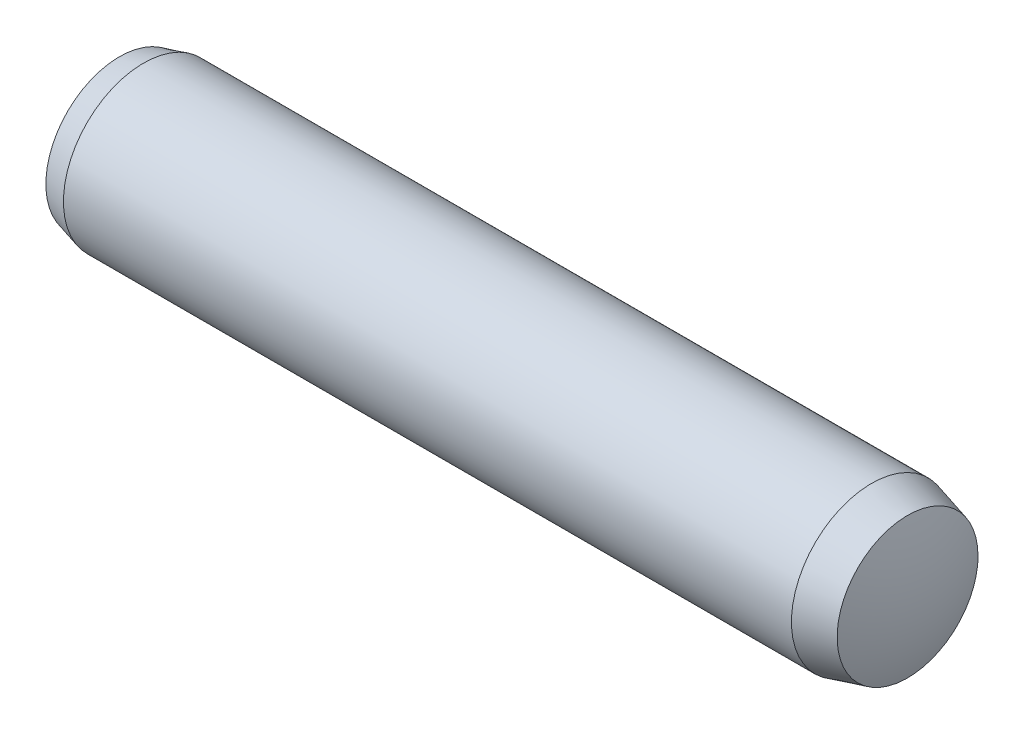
ISO-10303-21;
HEADER;
FILE_DESCRIPTION(('STEP AP214'),'2;1');
FILE_NAME('part.step','',(''),(''),'','','');
FILE_SCHEMA(('AUTOMOTIVE_DESIGN { 1 0 10303 214 1 1 1 1 }'));
ENDSEC;
DATA;
#1=APPLICATION_CONTEXT('core data for automotive mechanical design processes');
#2=APPLICATION_PROTOCOL_DEFINITION('international standard','automotive_design',2000,#1);
#3=PRODUCT_CONTEXT('',#1,'mechanical');
#4=PRODUCT('Part','Part','',(#3));
#5=PRODUCT_RELATED_PRODUCT_CATEGORY('part','',(#4));
#6=PRODUCT_DEFINITION_FORMATION('','',#4);
#7=PRODUCT_DEFINITION_CONTEXT('part definition',#1,'design');
#8=PRODUCT_DEFINITION('design','',#6,#7);
#9=PRODUCT_DEFINITION_SHAPE('','',#8);
#10=(LENGTH_UNIT() NAMED_UNIT(*) SI_UNIT(.MILLI.,.METRE.));
#11=(NAMED_UNIT(*) PLANE_ANGLE_UNIT() SI_UNIT($,.RADIAN.));
#12=(NAMED_UNIT(*) SI_UNIT($,.STERADIAN.) SOLID_ANGLE_UNIT());
#13=UNCERTAINTY_MEASURE_WITH_UNIT(LENGTH_MEASURE(1.E-05),#10,'distance_accuracy_value','');
#14=(GEOMETRIC_REPRESENTATION_CONTEXT(3) GLOBAL_UNCERTAINTY_ASSIGNED_CONTEXT((#13)) GLOBAL_UNIT_ASSIGNED_CONTEXT((#10,
#11,#12)) REPRESENTATION_CONTEXT('',''));
#15=CARTESIAN_POINT('',(0.,0.,0.));
#16=DIRECTION('',(0.,0.,1.));
#17=DIRECTION('',(1.,0.,0.));
#18=AXIS2_PLACEMENT_3D('',#15,#16,#17);
#19=CARTESIAN_POINT('',(8.8,0.,0.));
#20=DIRECTION('',(-1.,0.,0.));
#21=DIRECTION('',(0.,0.,1.));
#22=AXIS2_PLACEMENT_3D('',#19,#20,#21);
#23=CONICAL_SURFACE('',#22,2.01,1.04719755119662);
#24=CARTESIAN_POINT('',(9.9604740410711,0.,0.));
#25=VERTEX_POINT('',#24);
#26=VERTEX_LOOP('',#25);
#27=FACE_BOUND('',#26,.T.);
#28=CARTESIAN_POINT('',(8.8,0.,0.));
#29=DIRECTION('',(1.,0.,0.));
#30=DIRECTION('',(0.,0.,-1.));
#31=AXIS2_PLACEMENT_3D('',#28,#29,#30);
#32=CIRCLE('',#31,2.01);
#33=CARTESIAN_POINT('',(8.8,0.,-2.01));
#34=VERTEX_POINT('',#33);
#35=EDGE_CURVE('E48',#34,#34,#32,.T.);
#36=ORIENTED_EDGE('',*,*,#35,.F.);
#37=EDGE_LOOP('',(#36));
#38=FACE_BOUND('',#37,.T.);
#39=ADVANCED_FACE('F36',(#27,#38),#23,.F.);
#40=CARTESIAN_POINT('',(40.,0.,0.));
#41=DIRECTION('',(1.,0.,0.));
#42=DIRECTION('',(0.,0.,-1.));
#43=AXIS2_PLACEMENT_3D('',#40,#41,#42);
#44=CYLINDRICAL_SURFACE('',#43,2.01);
#45=ORIENTED_EDGE('',*,*,#35,.T.);
#46=EDGE_LOOP('',(#45));
#47=FACE_BOUND('',#46,.T.);
#48=CARTESIAN_POINT('',(0.800000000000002,0.,0.));
#49=DIRECTION('',(1.,0.,0.));
#50=DIRECTION('',(0.,0.,-1.));
#51=AXIS2_PLACEMENT_3D('',#48,#49,#50);
#52=CIRCLE('',#51,2.01);
#53=CARTESIAN_POINT('',(0.800000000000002,0.,-2.01));
#54=VERTEX_POINT('',#53);
#55=EDGE_CURVE('E97',#54,#54,#52,.T.);
#56=ORIENTED_EDGE('',*,*,#55,.F.);
#57=EDGE_LOOP('',(#56));
#58=FACE_BOUND('',#57,.T.);
#59=ADVANCED_FACE('F102',(#47,#58),#44,.F.);
#60=CARTESIAN_POINT('',(0.8,0.,-2.01));
#61=DIRECTION('',(-1.,0.,0.));
#62=DIRECTION('',(0.,0.,1.));
#63=AXIS2_PLACEMENT_3D('',#60,#61,#62);
#64=PLANE('',#63);
#65=ORIENTED_EDGE('',*,*,#55,.T.);
#66=EDGE_LOOP('',(#65));
#67=FACE_BOUND('',#66,.T.);
#68=CARTESIAN_POINT('',(0.800000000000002,0.,0.));
#69=DIRECTION('',(1.,0.,0.));
#70=DIRECTION('',(0.,0.,-1.));
#71=AXIS2_PLACEMENT_3D('',#68,#69,#70);
#72=CIRCLE('',#71,3.25);
#73=CARTESIAN_POINT('',(0.800000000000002,0.,-3.25));
#74=VERTEX_POINT('',#73);
#75=EDGE_CURVE('E94',#74,#74,#72,.T.);
#76=ORIENTED_EDGE('',*,*,#75,.F.);
#77=EDGE_LOOP('',(#76));
#78=FACE_BOUND('',#77,.T.);
#79=ADVANCED_FACE('F109',(#67,#78),#64,.T.);
#80=CARTESIAN_POINT('',(40.,0.,0.));
#81=DIRECTION('',(1.,0.,0.));
#82=DIRECTION('',(0.,0.,-1.));
#83=AXIS2_PLACEMENT_3D('',#80,#81,#82);
#84=CYLINDRICAL_SURFACE('',#83,3.25);
#85=ORIENTED_EDGE('',*,*,#75,.T.);
#86=EDGE_LOOP('',(#85));
#87=FACE_BOUND('',#86,.T.);
#88=CARTESIAN_POINT('',(0.,0.,0.));
#89=DIRECTION('',(1.,0.,0.));
#90=DIRECTION('',(0.,0.,-1.));
#91=AXIS2_PLACEMENT_3D('',#88,#89,#90);
#92=CIRCLE('',#91,3.25);
#93=CARTESIAN_POINT('',(0.,0.,-3.25));
#94=VERTEX_POINT('',#93);
#95=EDGE_CURVE('E87',#94,#94,#92,.T.);
#96=ORIENTED_EDGE('',*,*,#95,.F.);
#97=EDGE_LOOP('',(#96));
#98=FACE_BOUND('',#97,.T.);
#99=ADVANCED_FACE('F113',(#87,#98),#84,.F.);
#100=CARTESIAN_POINT('',(0.,0.,-3.25));
#101=DIRECTION('',(-1.,0.,0.));
#102=DIRECTION('',(0.,0.,1.));
#103=AXIS2_PLACEMENT_3D('',#100,#101,#102);
#104=PLANE('',#103);
#105=ORIENTED_EDGE('',*,*,#95,.T.);
#106=EDGE_LOOP('',(#105));
#107=FACE_BOUND('',#106,.T.);
#108=CARTESIAN_POINT('',(0.,0.,0.));
#109=DIRECTION('',(1.,0.,0.));
#110=DIRECTION('',(0.,0.,-1.));
#111=AXIS2_PLACEMENT_3D('',#108,#109,#110);
#112=CIRCLE('',#111,3.6784609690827);
#113=CARTESIAN_POINT('',(0.,0.,-3.6784609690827));
#114=VERTEX_POINT('',#113);
#115=EDGE_CURVE('E84',#114,#114,#112,.T.);
#116=ORIENTED_EDGE('',*,*,#115,.F.);
#117=EDGE_LOOP('',(#116));
#118=FACE_BOUND('',#117,.T.);
#119=ADVANCED_FACE('F119',(#107,#118),#104,.T.);
#120=CARTESIAN_POINT('',(1.2,0.,0.));
#121=DIRECTION('',(1.,0.,0.));
#122=DIRECTION('',(0.,0.,-1.));
#123=AXIS2_PLACEMENT_3D('',#120,#121,#122);
#124=CONICAL_SURFACE('',#123,4.,0.261799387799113);
#125=CARTESIAN_POINT('',(2.56615447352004,-1.82002192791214,-3.9686269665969));
#126=CARTESIAN_POINT('',(2.47861791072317,-1.76368052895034,-3.9686269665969));
#127=CARTESIAN_POINT('',(2.39195567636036,-1.70588387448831,-3.9686269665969));
#128=CARTESIAN_POINT('',(2.22088984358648,-1.58629618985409,-3.9686269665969));
#129=CARTESIAN_POINT('',(2.13649750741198,-1.52448911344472,-3.9686269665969));
#130=CARTESIAN_POINT('',(1.96789095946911,-1.39366145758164,-3.9686269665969));
#131=CARTESIAN_POINT('',(1.88382315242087,-1.32444987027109,-3.9686269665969));
#132=CARTESIAN_POINT('',(1.72139812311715,-1.17980611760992,-3.9686269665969));
#133=CARTESIAN_POINT('',(1.64303054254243,-1.10438579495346,-3.9686269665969));
#134=CARTESIAN_POINT('',(1.49757048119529,-0.948534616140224,-3.9686269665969));
#135=CARTESIAN_POINT('',(1.43016253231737,-0.868403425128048,-3.9686269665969));
#136=CARTESIAN_POINT('',(1.30826214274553,-0.699752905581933,-3.9686269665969));
#137=CARTESIAN_POINT('',(1.25363698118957,-0.611334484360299,-3.9686269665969));
#138=CARTESIAN_POINT('',(1.18138172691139,-0.461772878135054,-3.9686269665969));
#139=CARTESIAN_POINT('',(1.15765556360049,-0.403610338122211,-3.9686269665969));
#140=CARTESIAN_POINT('',(1.1193300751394,-0.28464914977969,-3.9686269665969));
#141=CARTESIAN_POINT('',(1.1046770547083,-0.223868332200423,-3.9686269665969));
#142=CARTESIAN_POINT('',(1.08590416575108,-0.10067944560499,-3.9686269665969));
#143=CARTESIAN_POINT('',(1.08177956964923,-0.0382721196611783,-3.9686269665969));
#144=CARTESIAN_POINT('',(1.08459246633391,0.0863557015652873,-3.9686269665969));
#145=CARTESIAN_POINT('',(1.0915421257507,0.148575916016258,-3.9686269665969));
#146=CARTESIAN_POINT('',(1.11563331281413,0.270941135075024,-3.9686269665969));
#147=CARTESIAN_POINT('',(1.13277564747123,0.33108597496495,-3.9686269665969));
#148=CARTESIAN_POINT('',(1.18426902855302,0.472297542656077,-3.9686269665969));
#149=CARTESIAN_POINT('',(1.22279536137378,0.551819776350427,-3.9686269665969));
#150=CARTESIAN_POINT('',(1.31182615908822,0.704543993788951,-3.9686269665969));
#151=CARTESIAN_POINT('',(1.36244163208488,0.777678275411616,-3.9686269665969));
#152=CARTESIAN_POINT('',(1.48384015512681,0.933412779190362,-3.9686269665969));
#153=CARTESIAN_POINT('',(1.5565989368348,1.01444433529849,-3.9686269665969));
#154=CARTESIAN_POINT('',(1.70979689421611,1.16919817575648,-3.9686269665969));
#155=CARTESIAN_POINT('',(1.79026027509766,1.24289583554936,-3.9686269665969));
#156=CARTESIAN_POINT('',(1.95246180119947,1.3812137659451,-3.9686269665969));
#157=CARTESIAN_POINT('',(2.0339829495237,1.44609231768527,-3.9686269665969));
#158=CARTESIAN_POINT('',(2.1997445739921,1.57101808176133,-3.9686269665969));
#159=CARTESIAN_POINT('',(2.28396126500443,1.63109669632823,-3.9686269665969));
#160=CARTESIAN_POINT('',(2.36921445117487,1.68951804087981,-3.9686269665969));
#161=B_SPLINE_CURVE_WITH_KNOTS('',3,(#125,#126,#127,#128,#129,#130,#131,#132,#133,#134,#135,
#136,#137,#138,#139,#140,#141,#142,#143,#144,#145,#146,#147,#148,#149,#150,#151,#152,#153,#154,
#155,#156,#157,#158,#159,#160),.UNSPECIFIED.,.F.,.F.,(4,2,2,2,2,2,2,2,2,2,2,2,2,2,2,2,2,4),(0.,
0.312367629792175,0.626073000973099,0.952517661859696,1.27835347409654,1.59179667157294,
1.90182469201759,2.08969168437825,2.27643597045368,2.46309638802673,2.64996201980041,
2.83684244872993,3.10042354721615,3.36652490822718,3.69245455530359,4.01944403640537,
4.33184638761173,4.64200105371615),.UNSPECIFIED.);
#162=CARTESIAN_POINT('',(1.2,-0.5,-3.9686269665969));
#163=VERTEX_POINT('',#162);
#164=CARTESIAN_POINT('',(1.2,0.5,-3.9686269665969));
#165=VERTEX_POINT('',#164);
#166=EDGE_CURVE('E66',#163,#165,#161,.T.);
#167=ORIENTED_EDGE('',*,*,#166,.F.);
#168=CARTESIAN_POINT('',(1.2,0.,0.));
#169=DIRECTION('',(1.,0.,0.));
#170=DIRECTION('',(0.,0.,-1.));
#171=AXIS2_PLACEMENT_3D('',#168,#169,#170);
#172=CIRCLE('',#171,4.);
#173=EDGE_CURVE('E78',#165,#163,#172,.T.);
#174=ORIENTED_EDGE('',*,*,#173,.F.);
#175=EDGE_LOOP('',(#167,#174));
#176=FACE_BOUND('',#175,.T.);
#177=ORIENTED_EDGE('',*,*,#115,.T.);
#178=EDGE_LOOP('',(#177));
#179=FACE_BOUND('',#178,.T.);
#180=ADVANCED_FACE('F82',(#176,#179),#124,.T.);
#181=CARTESIAN_POINT('',(40.,0.,0.));
#182=DIRECTION('',(1.,0.,0.));
#183=DIRECTION('',(0.,0.,-1.));
#184=AXIS2_PLACEMENT_3D('',#181,#182,#183);
#185=CYLINDRICAL_SURFACE('',#184,4.);
#186=DIRECTION('',(-1.,0.,0.));
#187=VECTOR('',#186,1.);
#188=CARTESIAN_POINT('',(40.8,-0.5,-3.9686269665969));
#189=LINE('',#188,#187);
#190=CARTESIAN_POINT('',(37.56,-0.5,-3.9686269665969));
#191=VERTEX_POINT('',#190);
#192=EDGE_CURVE('E69',#191,#163,#189,.T.);
#193=ORIENTED_EDGE('',*,*,#192,.F.);
#194=CARTESIAN_POINT('',(37.56,0.,0.));
#195=DIRECTION('',(1.,0.,0.));
#196=DIRECTION('',(0.,0.,-1.));
#197=AXIS2_PLACEMENT_3D('',#194,#195,#196);
#198=CIRCLE('',#197,4.);
#199=CARTESIAN_POINT('',(37.56,0.499999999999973,-3.96862696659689));
#200=VERTEX_POINT('',#199);
#201=EDGE_CURVE('E80',#200,#191,#198,.T.);
#202=ORIENTED_EDGE('',*,*,#201,.F.);
#203=DIRECTION('',(-1.,0.,0.));
#204=VECTOR('',#203,1.);
#205=CARTESIAN_POINT('',(40.8,0.5,-3.9686269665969));
#206=LINE('',#205,#204);
#207=EDGE_CURVE('E54',#200,#165,#206,.T.);
#208=ORIENTED_EDGE('',*,*,#207,.T.);
#209=ORIENTED_EDGE('',*,*,#173,.T.);
#210=EDGE_LOOP('',(#193,#202,#208,#209));
#211=FACE_BOUND('',#210,.T.);
#212=ADVANCED_FACE('F77',(#211),#185,.T.);
#213=CARTESIAN_POINT('',(39.360965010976,0.,0.));
#214=DIRECTION('',(-1.,0.,0.));
#215=DIRECTION('',(0.,0.,1.));
#216=AXIS2_PLACEMENT_3D('',#213,#214,#215);
#217=CONICAL_SURFACE('',#216,3.5174328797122,0.261799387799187);
#218=CARTESIAN_POINT('',(36.850640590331,-1.34413753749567,-3.9686269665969));
#219=CARTESIAN_POINT('',(36.8958566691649,-1.30634733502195,-3.9686269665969));
#220=CARTESIAN_POINT('',(36.9404061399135,-1.26772777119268,-3.9686269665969));
#221=CARTESIAN_POINT('',(37.0278469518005,-1.18848770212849,-3.9686269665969));
#222=CARTESIAN_POINT('',(37.0707347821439,-1.1478633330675,-3.9686269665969));
#223=CARTESIAN_POINT('',(37.1552953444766,-1.06347009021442,-3.9686269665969));
#224=CARTESIAN_POINT('',(37.1969180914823,-1.01965064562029,-3.9686269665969));
#225=CARTESIAN_POINT('',(37.2772082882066,-0.929434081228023,-3.9686269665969));
#226=CARTESIAN_POINT('',(37.3158780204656,-0.883039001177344,-3.9686269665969));
#227=CARTESIAN_POINT('',(37.405308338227,-0.766696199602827,-3.9686269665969));
#228=CARTESIAN_POINT('',(37.4541091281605,-0.695206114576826,-3.9686269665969));
#229=CARTESIAN_POINT('',(37.5400394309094,-0.546038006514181,-3.9686269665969));
#230=CARTESIAN_POINT('',(37.5772664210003,-0.468418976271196,-3.9686269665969));
#231=CARTESIAN_POINT('',(37.6164633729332,-0.360477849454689,-3.9686269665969));
#232=CARTESIAN_POINT('',(37.6255053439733,-0.332677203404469,-3.9686269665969));
#233=CARTESIAN_POINT('',(37.6415647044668,-0.276450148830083,-3.9686269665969));
#234=CARTESIAN_POINT('',(37.6485788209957,-0.248022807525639,-3.9686269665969));
#235=CARTESIAN_POINT('',(37.6670973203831,-0.158042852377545,-3.9686269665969));
#236=CARTESIAN_POINT('',(37.6746296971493,-0.095603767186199,-3.9686269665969));
#237=CARTESIAN_POINT('',(37.6785183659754,0.0296237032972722,-3.9686269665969));
#238=CARTESIAN_POINT('',(37.6748713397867,0.092412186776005,-3.9686269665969));
#239=CARTESIAN_POINT('',(37.6569228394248,0.216164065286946,-3.9686269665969));
#240=CARTESIAN_POINT('',(37.642661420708,0.277133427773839,-3.9686269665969));
#241=CARTESIAN_POINT('',(37.6051287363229,0.396151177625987,-3.9686269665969));
#242=CARTESIAN_POINT('',(37.5818552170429,0.454198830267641,-3.9686269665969));
#243=CARTESIAN_POINT('',(37.5106520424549,0.603758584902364,-3.9686269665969));
#244=CARTESIAN_POINT('',(37.4565531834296,0.692317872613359,-3.9686269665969));
#245=CARTESIAN_POINT('',(37.3660379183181,0.818662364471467,-3.9686269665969));
#246=CARTESIAN_POINT('',(37.3341057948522,0.85990049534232,-3.9686269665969));
#247=CARTESIAN_POINT('',(37.2677329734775,0.94030253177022,-3.9686269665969));
#248=CARTESIAN_POINT('',(37.2332932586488,0.97946723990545,-3.9686269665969));
#249=CARTESIAN_POINT('',(37.146279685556,1.07333563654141,-3.9686269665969));
#250=CARTESIAN_POINT('',(37.0925882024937,1.12699611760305,-3.9686269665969));
#251=CARTESIAN_POINT('',(36.9820557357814,1.2309891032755,-3.9686269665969));
#252=CARTESIAN_POINT('',(36.9252130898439,1.28131982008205,-3.9686269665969));
#253=CARTESIAN_POINT('',(36.7507824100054,1.4284144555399,-3.9686269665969));
#254=CARTESIAN_POINT('',(36.6296266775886,1.52093797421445,-3.9686269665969));
#255=CARTESIAN_POINT('',(36.3887556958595,1.69265315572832,-3.9686269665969));
#256=CARTESIAN_POINT('',(36.2693607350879,1.77230603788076,-3.9686269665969));
#257=CARTESIAN_POINT('',(36.0881209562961,1.88728374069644,-3.9686269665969));
#258=CARTESIAN_POINT('',(36.0276011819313,1.92471560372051,-3.9686269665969));
#259=CARTESIAN_POINT('',(35.905837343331,1.99834724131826,-3.9686269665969));
#260=CARTESIAN_POINT('',(35.8445934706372,2.03454733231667,-3.9686269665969));
#261=CARTESIAN_POINT('',(35.7830419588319,2.07021250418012,-3.9686269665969));
#262=B_SPLINE_CURVE_WITH_KNOTS('',3,(#218,#219,#220,#221,#222,#223,#224,#225,#226,#227,#228,
#229,#230,#231,#232,#233,#234,#235,#236,#237,#238,#239,#240,#241,#242,#243,#244,#245,#246,#247,
#248,#249,#250,#251,#252,#253,#254,#255,#256,#257,#258,#259,#260,#261),.UNSPECIFIED.,.F.,.F.,(4,
2,2,2,2,2,2,2,2,2,2,2,2,2,2,2,2,2,2,2,2,4),(0.,0.176806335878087,0.353967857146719,
0.53516787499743,0.716226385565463,0.975215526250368,1.23196029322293,1.31959590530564,
1.40737218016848,1.59502515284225,1.78273382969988,1.96973772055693,2.15678840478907,
2.46621715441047,2.62263815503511,2.77899815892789,3.00654371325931,3.23421046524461,
3.69097515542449,4.12138299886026,4.33485099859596,4.54826374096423),.UNSPECIFIED.);
#263=EDGE_CURVE('E11',#200,#191,#262,.F.);
#264=ORIENTED_EDGE('',*,*,#263,.F.);
#265=ORIENTED_EDGE('',*,*,#201,.T.);
#266=EDGE_LOOP('',(#264,#265));
#267=FACE_BOUND('',#266,.T.);
#268=CARTESIAN_POINT('',(39.360965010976,0.,0.));
#269=DIRECTION('',(1.,0.,0.));
#270=DIRECTION('',(0.,0.,-1.));
#271=AXIS2_PLACEMENT_3D('',#268,#269,#270);
#272=CIRCLE('',#271,3.5174328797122);
#273=CARTESIAN_POINT('',(39.360965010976,0.,-3.5174328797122));
#274=VERTEX_POINT('',#273);
#275=EDGE_CURVE('E73',#274,#274,#272,.T.);
#276=ORIENTED_EDGE('',*,*,#275,.F.);
#277=EDGE_LOOP('',(#276));
#278=FACE_BOUND('',#277,.T.);
#279=ADVANCED_FACE('F137',(#267,#278),#217,.T.);
#280=CARTESIAN_POINT('',(29.9999999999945,0.,1.3765030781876E-12));
#281=DIRECTION('',(1.,0.,0.));
#282=DIRECTION('',(0.,0.,-1.));
#283=AXIS2_PLACEMENT_3D('',#280,#281,#282);
#284=SPHERICAL_SURFACE('',#283,10.0000000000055);
#285=ORIENTED_EDGE('',*,*,#275,.T.);
#286=EDGE_LOOP('',(#285));
#287=FACE_BOUND('',#286,.T.);
#288=ADVANCED_FACE('F134',(#287),#284,.T.);
#289=CARTESIAN_POINT('',(40.8,-0.5,-3.9686269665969));
#290=DIRECTION('',(0.,0.,1.));
#291=DIRECTION('',(1.,0.,0.));
#292=AXIS2_PLACEMENT_3D('',#289,#290,#291);
#293=PLANE('',#292);
#294=ORIENTED_EDGE('',*,*,#166,.T.);
#295=ORIENTED_EDGE('',*,*,#207,.F.);
#296=ORIENTED_EDGE('',*,*,#263,.T.);
#297=ORIENTED_EDGE('',*,*,#192,.T.);
#298=EDGE_LOOP('',(#294,#295,#296,#297));
#299=FACE_BOUND('',#298,.T.);
#300=ADVANCED_FACE('F67',(#299),#293,.F.);
#301=CLOSED_SHELL('',(#39,#59,#79,#99,#119,#180,#212,#279,#288,#300));
#302=MANIFOLD_SOLID_BREP('B2',#301);
#303=ADVANCED_BREP_SHAPE_REPRESENTATION('',(#18,#302),#14);
#304=SHAPE_DEFINITION_REPRESENTATION(#9,#303);
ENDSEC;
END-ISO-10303-21;
